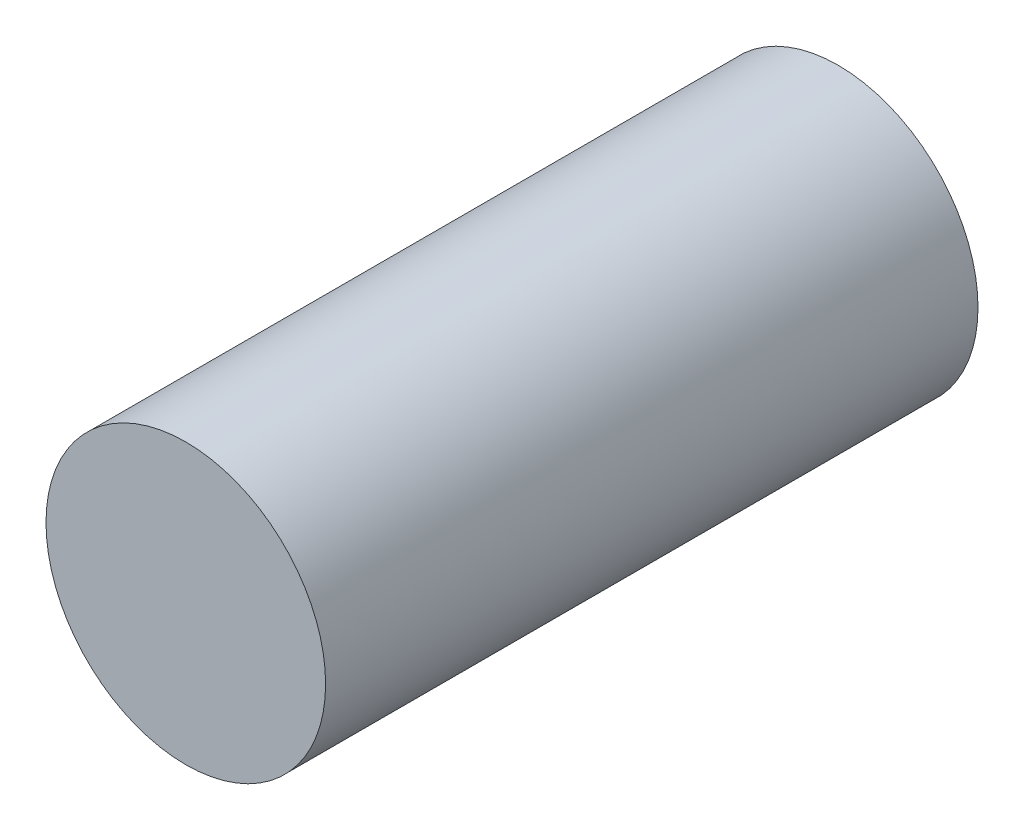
from build123d import *

# Parameters (mm, degrees)
SKETCH1_R           = 3
BOSS_EXTRUDE1_DEPTH = 14


with BuildPart() as part:
    # Sketch1 → Boss-Extrude1 (new body)
    with BuildSketch(Plane.XY):
        Circle(SKETCH1_R)
    extrude(amount=BOSS_EXTRUDE1_DEPTH)


solid = part.part
